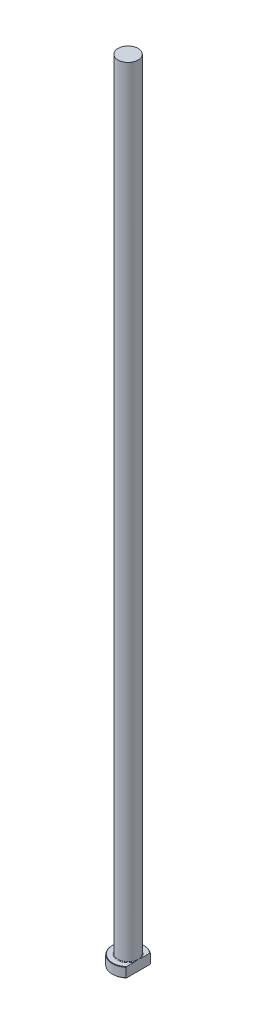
ISO-10303-21;
HEADER;
FILE_DESCRIPTION(('STEP AP214'),'2;1');
FILE_NAME('part.step','',(''),(''),'','','');
FILE_SCHEMA(('AUTOMOTIVE_DESIGN { 1 0 10303 214 1 1 1 1 }'));
ENDSEC;
DATA;
#1=APPLICATION_CONTEXT('core data for automotive mechanical design processes');
#2=APPLICATION_PROTOCOL_DEFINITION('international standard','automotive_design',2000,#1);
#3=PRODUCT_CONTEXT('',#1,'mechanical');
#4=PRODUCT('Part','Part','',(#3));
#5=PRODUCT_RELATED_PRODUCT_CATEGORY('part','',(#4));
#6=PRODUCT_DEFINITION_FORMATION('','',#4);
#7=PRODUCT_DEFINITION_CONTEXT('part definition',#1,'design');
#8=PRODUCT_DEFINITION('design','',#6,#7);
#9=PRODUCT_DEFINITION_SHAPE('','',#8);
#10=(LENGTH_UNIT() NAMED_UNIT(*) SI_UNIT(.MILLI.,.METRE.));
#11=(NAMED_UNIT(*) PLANE_ANGLE_UNIT() SI_UNIT($,.RADIAN.));
#12=(NAMED_UNIT(*) SI_UNIT($,.STERADIAN.) SOLID_ANGLE_UNIT());
#13=UNCERTAINTY_MEASURE_WITH_UNIT(LENGTH_MEASURE(1.E-05),#10,'distance_accuracy_value','');
#14=(GEOMETRIC_REPRESENTATION_CONTEXT(3) GLOBAL_UNCERTAINTY_ASSIGNED_CONTEXT((#13)) GLOBAL_UNIT_ASSIGNED_CONTEXT((#10,
#11,#12)) REPRESENTATION_CONTEXT('',''));
#15=CARTESIAN_POINT('',(0.,0.,0.));
#16=DIRECTION('',(0.,0.,1.));
#17=DIRECTION('',(1.,0.,0.));
#18=AXIS2_PLACEMENT_3D('',#15,#16,#17);
#19=CARTESIAN_POINT('',(0.,0.,0.));
#20=DIRECTION('',(0.,-1.,0.));
#21=DIRECTION('',(0.,0.,-1.));
#22=AXIS2_PLACEMENT_3D('',#19,#20,#21);
#23=PLANE('',#22);
#24=CARTESIAN_POINT('',(0.,0.,0.));
#25=DIRECTION('',(0.,-1.,0.));
#26=DIRECTION('',(0.,0.,-1.));
#27=AXIS2_PLACEMENT_3D('',#24,#25,#26);
#28=CIRCLE('',#27,7.79999999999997);
#29=CARTESIAN_POINT('',(5.09999999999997,0.,5.90169467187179));
#30=VERTEX_POINT('',#29);
#31=CARTESIAN_POINT('',(5.09999999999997,0.,-5.90169467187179));
#32=VERTEX_POINT('',#31);
#33=EDGE_CURVE('E98',#30,#32,#28,.T.);
#34=ORIENTED_EDGE('',*,*,#33,.T.);
#35=DIRECTION('',(0.,0.,1.));
#36=VECTOR('',#35,1.);
#37=CARTESIAN_POINT('',(5.09999999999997,0.,-6.16360284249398));
#38=LINE('',#37,#36);
#39=EDGE_CURVE('E83',#32,#30,#38,.T.);
#40=ORIENTED_EDGE('',*,*,#39,.T.);
#41=EDGE_LOOP('',(#34,#40));
#42=FACE_BOUND('',#41,.T.);
#43=ADVANCED_FACE('F32',(#42),#23,.T.);
#44=CARTESIAN_POINT('',(0.,259.958771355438,0.));
#45=DIRECTION('',(0.,1.,0.));
#46=DIRECTION('',(0.,0.,1.));
#47=AXIS2_PLACEMENT_3D('',#44,#45,#46);
#48=CYLINDRICAL_SURFACE('',#47,7.99999999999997);
#49=CARTESIAN_POINT('',(0.,4.79999999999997,0.));
#50=DIRECTION('',(0.,1.,0.));
#51=DIRECTION('',(0.,0.,1.));
#52=AXIS2_PLACEMENT_3D('',#49,#50,#51);
#53=CIRCLE('',#52,7.99999999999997);
#54=CARTESIAN_POINT('',(5.09999999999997,4.79999999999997,6.16360284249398));
#55=VERTEX_POINT('',#54);
#56=CARTESIAN_POINT('',(5.09999999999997,4.79999999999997,-6.16360284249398));
#57=VERTEX_POINT('',#56);
#58=EDGE_CURVE('E104',#55,#57,#53,.F.);
#59=ORIENTED_EDGE('',*,*,#58,.T.);
#60=DIRECTION('',(0.,-1.,0.));
#61=VECTOR('',#60,1.);
#62=CARTESIAN_POINT('',(5.09999999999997,400.,-6.16360284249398));
#63=LINE('',#62,#61);
#64=CARTESIAN_POINT('',(5.09999999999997,0.199999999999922,-6.16360284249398));
#65=VERTEX_POINT('',#64);
#66=EDGE_CURVE('E183',#57,#65,#63,.T.);
#67=ORIENTED_EDGE('',*,*,#66,.T.);
#68=CARTESIAN_POINT('',(0.,0.199999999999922,0.));
#69=DIRECTION('',(0.,-1.,0.));
#70=DIRECTION('',(0.,0.,-1.));
#71=AXIS2_PLACEMENT_3D('',#68,#69,#70);
#72=CIRCLE('',#71,7.99999999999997);
#73=CARTESIAN_POINT('',(5.09999999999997,0.199999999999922,6.16360284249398));
#74=VERTEX_POINT('',#73);
#75=EDGE_CURVE('E100',#65,#74,#72,.F.);
#76=ORIENTED_EDGE('',*,*,#75,.T.);
#77=DIRECTION('',(0.,-1.,0.));
#78=VECTOR('',#77,1.);
#79=CARTESIAN_POINT('',(5.09999999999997,400.,6.16360284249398));
#80=LINE('',#79,#78);
#81=EDGE_CURVE('E93',#55,#74,#80,.T.);
#82=ORIENTED_EDGE('',*,*,#81,.F.);
#83=EDGE_LOOP('',(#59,#67,#76,#82));
#84=FACE_BOUND('',#83,.T.);
#85=ADVANCED_FACE('F158',(#84),#48,.T.);
#86=CARTESIAN_POINT('',(-7.99999999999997,5.,0.));
#87=DIRECTION('',(0.,1.,0.));
#88=DIRECTION('',(0.,0.,1.));
#89=AXIS2_PLACEMENT_3D('',#86,#87,#88);
#90=PLANE('',#89);
#91=CARTESIAN_POINT('',(0.,5.,0.));
#92=DIRECTION('',(0.,1.,0.));
#93=DIRECTION('',(0.,0.,1.));
#94=AXIS2_PLACEMENT_3D('',#91,#92,#93);
#95=CIRCLE('',#94,7.79999999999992);
#96=CARTESIAN_POINT('',(5.09999999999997,5.,-5.90169467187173));
#97=VERTEX_POINT('',#96);
#98=CARTESIAN_POINT('',(5.09999999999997,5.,5.90169467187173));
#99=VERTEX_POINT('',#98);
#100=EDGE_CURVE('E178',#97,#99,#95,.T.);
#101=ORIENTED_EDGE('',*,*,#100,.T.);
#102=DIRECTION('',(0.,0.,-1.));
#103=VECTOR('',#102,1.);
#104=CARTESIAN_POINT('',(5.09999999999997,5.,0.));
#105=LINE('',#104,#103);
#106=CARTESIAN_POINT('',(5.09999999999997,4.99999999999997,1.77482393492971));
#107=VERTEX_POINT('',#106);
#108=EDGE_CURVE('E57',#99,#107,#105,.T.);
#109=ORIENTED_EDGE('',*,*,#108,.T.);
#110=CARTESIAN_POINT('',(0.,5.,0.));
#111=DIRECTION('',(0.,1.,0.));
#112=DIRECTION('',(0.,0.,1.));
#113=AXIS2_PLACEMENT_3D('',#110,#111,#112);
#114=CIRCLE('',#113,5.39999999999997);
#115=CARTESIAN_POINT('',(5.09999999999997,4.99999999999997,-1.77482393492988));
#116=VERTEX_POINT('',#115);
#117=EDGE_CURVE('E107',#107,#116,#114,.F.);
#118=ORIENTED_EDGE('',*,*,#117,.T.);
#119=EDGE_CURVE('E136',#116,#97,#105,.T.);
#120=ORIENTED_EDGE('',*,*,#119,.T.);
#121=EDGE_LOOP('',(#101,#109,#118,#120));
#122=FACE_BOUND('',#121,.T.);
#123=ADVANCED_FACE('F147',(#122),#90,.T.);
#124=CARTESIAN_POINT('',(0.,5.,0.));
#125=DIRECTION('',(0.,-1.,0.));
#126=DIRECTION('',(0.,0.,-1.));
#127=AXIS2_PLACEMENT_3D('',#124,#125,#126);
#128=CONICAL_SURFACE('',#127,7.79999999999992,0.785398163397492);
#129=ORIENTED_EDGE('',*,*,#58,.F.);
#130=CARTESIAN_POINT('',(5.09999999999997,-1.68838926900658,13.5610996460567));
#131=CARTESIAN_POINT('',(5.09999999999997,-1.49117445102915,13.3503958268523));
#132=CARTESIAN_POINT('',(5.09999999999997,-1.29425912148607,13.1394117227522));
#133=CARTESIAN_POINT('',(5.09999999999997,-0.90112453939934,12.7167935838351));
#134=CARTESIAN_POINT('',(5.09999999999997,-0.704905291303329,12.5051595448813));
#135=CARTESIAN_POINT('',(5.09999999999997,-0.117342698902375,11.8690459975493));
#136=CARTESIAN_POINT('',(5.09999999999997,0.272806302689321,11.4434608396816));
#137=CARTESIAN_POINT('',(5.09999999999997,1.05193640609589,10.5848872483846));
#138=CARTESIAN_POINT('',(5.09999999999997,1.44088225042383,10.1518667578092));
#139=CARTESIAN_POINT('',(5.09999999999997,2.21252525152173,9.28039822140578));
#140=CARTESIAN_POINT('',(5.09999999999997,2.59522339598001,8.84195105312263));
#141=CARTESIAN_POINT('',(5.09999999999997,3.28346545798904,8.03678680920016));
#142=CARTESIAN_POINT('',(5.09999999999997,3.59050446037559,7.67135442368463));
#143=CARTESIAN_POINT('',(5.09999999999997,4.04444149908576,7.1176457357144));
#144=CARTESIAN_POINT('',(5.09999999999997,4.19468098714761,6.93211011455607));
#145=CARTESIAN_POINT('',(5.09999999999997,4.49242146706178,6.55885365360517));
#146=CARTESIAN_POINT('',(5.09999999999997,4.63992249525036,6.37113284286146));
#147=CARTESIAN_POINT('',(5.09999999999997,4.93124846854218,5.99346825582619));
#148=CARTESIAN_POINT('',(5.09999999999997,5.0750803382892,5.80352983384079));
#149=CARTESIAN_POINT('',(5.09999999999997,5.3585396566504,5.42051054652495));
#150=CARTESIAN_POINT('',(5.09999999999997,5.49816682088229,5.22742946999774));
#151=CARTESIAN_POINT('',(5.09999999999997,5.77196390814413,4.83761664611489));
#152=CARTESIAN_POINT('',(5.09999999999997,5.90613746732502,4.64088746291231));
#153=CARTESIAN_POINT('',(5.09999999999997,6.16753864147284,4.24288639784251));
#154=CARTESIAN_POINT('',(5.09999999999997,6.29476755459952,4.0416153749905));
#155=CARTESIAN_POINT('',(5.09999999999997,6.51869473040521,3.6691800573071));
#156=CARTESIAN_POINT('',(5.09999999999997,6.61684568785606,3.49889306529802));
#157=CARTESIAN_POINT('',(5.09999999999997,6.80528626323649,3.15396122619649));
#158=CARTESIAN_POINT('',(5.09999999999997,6.89557493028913,2.97931585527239));
#159=CARTESIAN_POINT('',(5.09999999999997,7.0660493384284,2.62530631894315));
#160=CARTESIAN_POINT('',(5.09999999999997,7.14624387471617,2.44594642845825));
#161=CARTESIAN_POINT('',(5.09999999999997,7.29389284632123,2.08202755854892));
#162=CARTESIAN_POINT('',(5.09999999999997,7.36135077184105,1.89747001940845));
#163=CARTESIAN_POINT('',(5.09999999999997,7.46787946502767,1.56242413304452));
#164=CARTESIAN_POINT('',(5.09999999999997,7.50993657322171,1.41289089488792));
#165=CARTESIAN_POINT('',(5.09999999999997,7.58244227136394,1.11101527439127));
#166=CARTESIAN_POINT('',(5.09999999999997,7.61289239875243,0.958673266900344));
#167=CARTESIAN_POINT('',(5.09999999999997,7.66066060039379,0.652384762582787));
#168=CARTESIAN_POINT('',(5.09999999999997,7.6780179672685,0.498444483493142));
#169=CARTESIAN_POINT('',(5.09999999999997,7.69880109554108,0.189616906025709));
#170=CARTESIAN_POINT('',(5.09999999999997,7.70222744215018,0.0347296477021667));
#171=CARTESIAN_POINT('',(5.09999999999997,7.69494415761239,-0.274953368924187));
#172=CARTESIAN_POINT('',(5.09999999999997,7.68421202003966,-0.429748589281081));
#173=CARTESIAN_POINT('',(5.09999999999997,7.64918519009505,-0.737784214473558));
#174=CARTESIAN_POINT('',(5.09999999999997,7.62488939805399,-0.89102449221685));
#175=CARTESIAN_POINT('',(5.09999999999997,7.56389278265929,-1.19546940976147));
#176=CARTESIAN_POINT('',(5.09999999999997,7.52715417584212,-1.34666637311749));
#177=CARTESIAN_POINT('',(5.09999999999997,7.44288917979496,-1.64598767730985));
#178=CARTESIAN_POINT('',(5.09999999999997,7.39536249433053,-1.79411193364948));
#179=CARTESIAN_POINT('',(5.09999999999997,7.2828636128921,-2.110452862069));
#180=CARTESIAN_POINT('',(5.09999999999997,7.21631794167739,-2.27810587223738));
#181=CARTESIAN_POINT('',(5.09999999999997,7.07327742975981,-2.60914825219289));
#182=CARTESIAN_POINT('',(5.09999999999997,6.99677812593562,-2.77253566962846));
#183=CARTESIAN_POINT('',(5.09999999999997,6.83568399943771,-3.09559415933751));
#184=CARTESIAN_POINT('',(5.09999999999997,6.75107532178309,-3.25525827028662));
#185=CARTESIAN_POINT('',(5.09999999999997,6.5754739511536,-3.57098467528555));
#186=CARTESIAN_POINT('',(5.09999999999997,6.48448213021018,-3.7270474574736));
#187=CARTESIAN_POINT('',(5.09999999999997,6.29613682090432,-4.03803676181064));
#188=CARTESIAN_POINT('',(5.09999999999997,6.19871627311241,-4.1929224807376));
#189=CARTESIAN_POINT('',(5.09999999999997,5.9995920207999,-4.49991023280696));
#190=CARTESIAN_POINT('',(5.09999999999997,5.89788820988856,-4.65201219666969));
#191=CARTESIAN_POINT('',(5.09999999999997,5.69108681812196,-4.95365388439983));
#192=CARTESIAN_POINT('',(5.09999999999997,5.58599284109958,-5.10319608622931));
#193=CARTESIAN_POINT('',(5.09999999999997,5.3729210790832,-5.40020343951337));
#194=CARTESIAN_POINT('',(5.09999999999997,5.26494333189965,-5.54766861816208));
#195=CARTESIAN_POINT('',(5.09999999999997,5.02178839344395,-5.87409503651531));
#196=CARTESIAN_POINT('',(5.09999999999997,4.88600343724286,-6.05260304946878));
#197=CARTESIAN_POINT('',(5.09999999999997,4.61149829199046,-6.40735082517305));
#198=CARTESIAN_POINT('',(5.09999999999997,4.4727780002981,-6.58359050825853));
#199=CARTESIAN_POINT('',(5.09999999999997,4.05300130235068,-7.10948762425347));
#200=CARTESIAN_POINT('',(5.09999999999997,3.76835961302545,-7.45628264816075));
#201=CARTESIAN_POINT('',(5.09999999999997,3.19218529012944,-8.14465597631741));
#202=CARTESIAN_POINT('',(5.09999999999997,2.90064601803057,-8.48622868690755));
#203=CARTESIAN_POINT('',(5.09999999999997,2.31275375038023,-9.16521513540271));
#204=CARTESIAN_POINT('',(5.09999999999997,2.0164006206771,-9.50262875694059));
#205=CARTESIAN_POINT('',(5.09999999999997,1.43877149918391,-10.1532482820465));
#206=CARTESIAN_POINT('',(5.09999999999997,1.15771277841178,-10.4666475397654));
#207=CARTESIAN_POINT('',(5.09999999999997,0.593133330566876,-11.0912313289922));
#208=CARTESIAN_POINT('',(5.09999999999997,0.309612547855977,-11.4024158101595));
#209=CARTESIAN_POINT('',(5.09999999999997,-0.258772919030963,-12.0223487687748));
#210=CARTESIAN_POINT('',(5.09999999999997,-0.543633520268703,-12.3311009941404));
#211=CARTESIAN_POINT('',(5.09999999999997,-1.11492174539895,-12.9471274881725));
#212=CARTESIAN_POINT('',(5.09999999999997,-1.4013492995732,-13.2544018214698));
#213=CARTESIAN_POINT('',(5.09999999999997,-1.68838926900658,-13.5610996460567));
#214=B_SPLINE_CURVE_WITH_KNOTS('',3,(#130,#131,#132,#133,#134,#135,#136,#137,#138,#139,#140,
#141,#142,#143,#144,#145,#146,#147,#148,#149,#150,#151,#152,#153,#154,#155,#156,#157,#158,#159,
#160,#161,#162,#163,#164,#165,#166,#167,#168,#169,#170,#171,#172,#173,#174,#175,#176,#177,#178,
#179,#180,#181,#182,#183,#184,#185,#186,#187,#188,#189,#190,#191,#192,#193,#194,#195,#196,#197,
#198,#199,#200,#201,#202,#203,#204,#205,#206,#207,#208,#209,#210,#211,#212,#213),.UNSPECIFIED.,
.F.,.F.,(4,2,2,2,2,2,2,2,2,2,2,2,2,2,2,2,2,2,2,2,2,2,2,2,2,2,2,2,2,2,2,2,2,2,2,2,2,2,2,2,2,4),
(0.,0.865798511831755,1.73160254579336,3.4636456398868,5.20976443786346,6.95560446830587,
8.38738766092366,9.10357880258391,9.81976043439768,10.5344719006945,11.249231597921,
11.9635066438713,12.677647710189,13.2671324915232,13.8566884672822,14.4457271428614,
15.0346041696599,15.5002159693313,15.9657660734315,16.4299133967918,16.8940412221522,
17.3589077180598,17.8238119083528,18.2901406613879,18.7564822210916,19.2972067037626,
19.838174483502,20.3800835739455,20.9219187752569,21.470762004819,22.01961887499,
22.5679103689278,23.1161946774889,23.7890028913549,24.4618346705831,25.807650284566,
27.1548185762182,28.5020244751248,29.7649097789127,31.0278236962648,32.2880803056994,
33.5482812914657),.UNSPECIFIED.);
#215=EDGE_CURVE('E135',#55,#99,#214,.T.);
#216=ORIENTED_EDGE('',*,*,#215,.T.);
#217=ORIENTED_EDGE('',*,*,#100,.F.);
#218=EDGE_CURVE('E127',#97,#57,#214,.T.);
#219=ORIENTED_EDGE('',*,*,#218,.T.);
#220=EDGE_LOOP('',(#129,#216,#217,#219));
#221=FACE_BOUND('',#220,.T.);
#222=ADVANCED_FACE('F143',(#221),#128,.T.);
#223=CARTESIAN_POINT('',(0.,0.199999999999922,0.));
#224=DIRECTION('',(0.,1.,0.));
#225=DIRECTION('',(0.,0.,1.));
#226=AXIS2_PLACEMENT_3D('',#223,#224,#225);
#227=CONICAL_SURFACE('',#226,7.99999999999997,0.78539816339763);
#228=ORIENTED_EDGE('',*,*,#75,.F.);
#229=CARTESIAN_POINT('',(5.09999999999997,6.68838926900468,-13.5610996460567));
#230=CARTESIAN_POINT('',(5.09999999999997,6.49117445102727,-13.3503958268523));
#231=CARTESIAN_POINT('',(5.09999999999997,6.29425912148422,-13.1394117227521));
#232=CARTESIAN_POINT('',(5.09999999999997,5.90112453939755,-12.7167935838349));
#233=CARTESIAN_POINT('',(5.09999999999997,5.70490529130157,-12.5051595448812));
#234=CARTESIAN_POINT('',(5.09999999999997,5.11734269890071,-11.869045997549));
#235=CARTESIAN_POINT('',(5.09999999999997,4.72719369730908,-11.4434608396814));
#236=CARTESIAN_POINT('',(5.09999999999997,3.94806359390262,-10.5848872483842));
#237=CARTESIAN_POINT('',(5.09999999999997,3.55911774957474,-10.1518667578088));
#238=CARTESIAN_POINT('',(5.09999999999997,2.78747474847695,-9.28039822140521));
#239=CARTESIAN_POINT('',(5.09999999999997,2.40477660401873,-8.84195105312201));
#240=CARTESIAN_POINT('',(5.09999999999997,1.71653454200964,-8.03678680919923));
#241=CARTESIAN_POINT('',(5.09999999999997,1.40949553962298,-7.67135442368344));
#242=CARTESIAN_POINT('',(5.09999999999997,0.955558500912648,-7.11764573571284));
#243=CARTESIAN_POINT('',(5.09999999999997,0.805319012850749,-6.93211011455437));
#244=CARTESIAN_POINT('',(5.09999999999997,0.507578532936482,-6.55885365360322));
#245=CARTESIAN_POINT('',(5.09999999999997,0.360077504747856,-6.37113284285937));
#246=CARTESIAN_POINT('',(5.09999999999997,0.0687515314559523,-5.99346825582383));
#247=CARTESIAN_POINT('',(5.09999999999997,-0.075080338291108,-5.8035298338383));
#248=CARTESIAN_POINT('',(5.09999999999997,-0.358539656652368,-5.42051054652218));
#249=CARTESIAN_POINT('',(5.09999999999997,-0.498166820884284,-5.22742946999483));
#250=CARTESIAN_POINT('',(5.09999999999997,-0.771963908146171,-4.8376166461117));
#251=CARTESIAN_POINT('',(5.09999999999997,-0.906137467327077,-4.64088746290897));
#252=CARTESIAN_POINT('',(5.09999999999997,-1.1675386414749,-4.24288639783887));
#253=CARTESIAN_POINT('',(5.09999999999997,-1.29476755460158,-4.0416153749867));
#254=CARTESIAN_POINT('',(5.09999999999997,-1.51869473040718,-3.6691800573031));
#255=CARTESIAN_POINT('',(5.09999999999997,-1.61684568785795,-3.49889306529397));
#256=CARTESIAN_POINT('',(5.09999999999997,-1.80528626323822,-3.15396122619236));
#257=CARTESIAN_POINT('',(5.09999999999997,-1.89557493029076,-2.97931585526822));
#258=CARTESIAN_POINT('',(5.09999999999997,-2.06604933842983,-2.62530631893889));
#259=CARTESIAN_POINT('',(5.09999999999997,-2.14624387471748,-2.44594642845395));
#260=CARTESIAN_POINT('',(5.09999999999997,-2.2938928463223,-2.08202755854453));
#261=CARTESIAN_POINT('',(5.09999999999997,-2.361350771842,-1.89747001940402));
#262=CARTESIAN_POINT('',(5.09999999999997,-2.46787946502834,-1.56242413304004));
#263=CARTESIAN_POINT('',(5.09999999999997,-2.50993657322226,-1.41289089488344));
#264=CARTESIAN_POINT('',(5.09999999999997,-2.58244227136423,-1.11101527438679));
#265=CARTESIAN_POINT('',(5.09999999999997,-2.61289239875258,-0.958673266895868));
#266=CARTESIAN_POINT('',(5.09999999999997,-2.66066060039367,-0.652384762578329));
#267=CARTESIAN_POINT('',(5.09999999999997,-2.67801796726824,-0.498444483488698));
#268=CARTESIAN_POINT('',(5.09999999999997,-2.69880109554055,-0.189616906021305));
#269=CARTESIAN_POINT('',(5.09999999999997,-2.70222744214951,-0.034729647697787));
#270=CARTESIAN_POINT('',(5.09999999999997,-2.69494415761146,0.274953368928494));
#271=CARTESIAN_POINT('',(5.09999999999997,-2.6842120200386,0.429748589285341));
#272=CARTESIAN_POINT('',(5.09999999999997,-2.64918519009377,0.737784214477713));
#273=CARTESIAN_POINT('',(5.09999999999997,-2.6248893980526,0.891024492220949));
#274=CARTESIAN_POINT('',(5.09999999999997,-2.56389278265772,1.19546940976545));
#275=CARTESIAN_POINT('',(5.09999999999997,-2.52715417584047,1.34666637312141));
#276=CARTESIAN_POINT('',(5.09999999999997,-2.44288917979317,1.64598767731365));
#277=CARTESIAN_POINT('',(5.09999999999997,-2.39536249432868,1.79411193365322));
#278=CARTESIAN_POINT('',(5.09999999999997,-2.28286361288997,2.11045286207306));
#279=CARTESIAN_POINT('',(5.09999999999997,-2.21631794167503,2.2781058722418));
#280=CARTESIAN_POINT('',(5.09999999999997,-2.07327742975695,2.60914825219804));
#281=CARTESIAN_POINT('',(5.09999999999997,-1.99677812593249,2.77253566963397));
#282=CARTESIAN_POINT('',(5.09999999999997,-1.83568399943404,3.0955941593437));
#283=CARTESIAN_POINT('',(5.09999999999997,-1.75107532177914,3.25525827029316));
#284=CARTESIAN_POINT('',(5.09999999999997,-1.57547395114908,3.57098467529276));
#285=CARTESIAN_POINT('',(5.09999999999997,-1.48448213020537,3.72704745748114));
#286=CARTESIAN_POINT('',(5.09999999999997,-1.29613682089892,4.03803676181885));
#287=CARTESIAN_POINT('',(5.09999999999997,-1.19871627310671,4.19292248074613));
#288=CARTESIAN_POINT('',(5.09999999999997,-0.999592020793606,4.49991023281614));
#289=CARTESIAN_POINT('',(5.09999999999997,-0.897888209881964,4.65201219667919));
#290=CARTESIAN_POINT('',(5.09999999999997,-0.691086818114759,4.95365388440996));
#291=CARTESIAN_POINT('',(5.09999999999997,-0.585992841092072,5.10319608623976));
#292=CARTESIAN_POINT('',(5.09999999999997,-0.372921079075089,5.40020343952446));
#293=CARTESIAN_POINT('',(5.09999999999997,-0.264943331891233,5.54766861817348));
#294=CARTESIAN_POINT('',(5.09999999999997,-0.0217883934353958,5.87409503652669));
#295=CARTESIAN_POINT('',(5.09999999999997,0.113996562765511,6.05260304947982));
#296=CARTESIAN_POINT('',(5.09999999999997,0.388501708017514,6.40735082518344));
#297=CARTESIAN_POINT('',(5.09999999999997,0.527221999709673,6.58359050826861));
#298=CARTESIAN_POINT('',(5.09999999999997,0.946998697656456,7.10948762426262));
#299=CARTESIAN_POINT('',(5.09999999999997,1.23164038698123,7.45628264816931));
#300=CARTESIAN_POINT('',(5.09999999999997,1.80781470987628,8.1446559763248));
#301=CARTESIAN_POINT('',(5.09999999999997,2.09935398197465,8.48622868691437));
#302=CARTESIAN_POINT('',(5.09999999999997,2.68724624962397,9.16521513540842));
#303=CARTESIAN_POINT('',(5.09999999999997,2.98359937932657,9.50262875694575));
#304=CARTESIAN_POINT('',(5.09999999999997,3.56122850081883,10.1532482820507));
#305=CARTESIAN_POINT('',(5.09999999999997,3.84228722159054,10.4666475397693));
#306=CARTESIAN_POINT('',(5.09999999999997,4.40686666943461,11.0912313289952));
#307=CARTESIAN_POINT('',(5.09999999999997,4.69038745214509,11.4024158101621));
#308=CARTESIAN_POINT('',(5.09999999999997,5.25877291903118,12.0223487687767));
#309=CARTESIAN_POINT('',(5.09999999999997,5.5436335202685,12.3311009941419));
#310=CARTESIAN_POINT('',(5.09999999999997,6.1149217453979,12.9471274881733));
#311=CARTESIAN_POINT('',(5.09999999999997,6.40134929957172,13.2544018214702));
#312=CARTESIAN_POINT('',(5.09999999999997,6.68838926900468,13.5610996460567));
#313=B_SPLINE_CURVE_WITH_KNOTS('',3,(#229,#230,#231,#232,#233,#234,#235,#236,#237,#238,#239,
#240,#241,#242,#243,#244,#245,#246,#247,#248,#249,#250,#251,#252,#253,#254,#255,#256,#257,#258,
#259,#260,#261,#262,#263,#264,#265,#266,#267,#268,#269,#270,#271,#272,#273,#274,#275,#276,#277,
#278,#279,#280,#281,#282,#283,#284,#285,#286,#287,#288,#289,#290,#291,#292,#293,#294,#295,#296,
#297,#298,#299,#300,#301,#302,#303,#304,#305,#306,#307,#308,#309,#310,#311,#312),.UNSPECIFIED.,
.F.,.F.,(4,2,2,2,2,2,2,2,2,2,2,2,2,2,2,2,2,2,2,2,2,2,2,2,2,2,2,2,2,2,2,2,2,2,2,2,2,2,2,2,2,4),
(0.,0.865798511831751,1.73160254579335,3.46364563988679,5.20976443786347,6.95560446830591,
8.38738766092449,9.10357880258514,9.8197604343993,10.5344719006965,11.2492315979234,
11.9635066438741,12.6776477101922,13.2671324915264,13.8566884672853,14.4457271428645,
15.034604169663,15.5002159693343,15.9657660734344,16.4299133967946,16.894041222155,
17.3589077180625,17.8238119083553,18.2901406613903,18.7564822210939,19.2972067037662,
19.8381744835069,20.3800835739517,20.9219187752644,21.4707620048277,22.0196188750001,
22.5679103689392,23.1161946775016,23.7890028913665,24.4618346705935,25.8076502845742,
27.1548185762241,28.5020244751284,29.7649097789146,31.027823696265,32.2880803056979,
33.5482812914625),.UNSPECIFIED.);
#314=EDGE_CURVE('E86',#65,#32,#313,.T.);
#315=ORIENTED_EDGE('',*,*,#314,.T.);
#316=ORIENTED_EDGE('',*,*,#33,.F.);
#317=EDGE_CURVE('E89',#30,#74,#313,.T.);
#318=ORIENTED_EDGE('',*,*,#317,.T.);
#319=EDGE_LOOP('',(#228,#315,#316,#318));
#320=FACE_BOUND('',#319,.T.);
#321=ADVANCED_FACE('F97',(#320),#227,.T.);
#322=CARTESIAN_POINT('',(0.,5.29999999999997,0.));
#323=DIRECTION('',(0.,1.,0.));
#324=DIRECTION('',(0.,0.,1.));
#325=AXIS2_PLACEMENT_3D('',#322,#323,#324);
#326=TOROIDAL_SURFACE('',#325,5.39999999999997,0.3);
#327=CARTESIAN_POINT('',(5.09999999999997,5.29999999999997,0.));
#328=CARTESIAN_POINT('',(5.09999999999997,5.30000062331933,1.00502423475E-10));
#329=CARTESIAN_POINT('',(5.09999999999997,5.30000124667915,-2.56272245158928E-07));
#330=CARTESIAN_POINT('',(5.09999999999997,5.30000240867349,-9.58155656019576E-07));
#331=CARTESIAN_POINT('',(5.09999999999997,5.30000293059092,-1.42128215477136E-06));
#332=CARTESIAN_POINT('',(5.09999999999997,5.30000402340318,-2.53262703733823E-06));
#333=CARTESIAN_POINT('',(5.09999999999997,5.30000457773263,-3.19888436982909E-06));
#334=CARTESIAN_POINT('',(5.09999999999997,5.30000556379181,-4.57422758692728E-06));
#335=CARTESIAN_POINT('',(5.09999999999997,5.30000599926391,-5.28085592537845E-06));
#336=CARTESIAN_POINT('',(5.09999999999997,5.30000763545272,-8.04031793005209E-06));
#337=CARTESIAN_POINT('',(5.09999999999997,5.30000874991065,-1.01478584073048E-05));
#338=CARTESIAN_POINT('',(5.09999999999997,5.30001056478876,-1.43037796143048E-05));
#339=CARTESIAN_POINT('',(5.09999999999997,5.30001129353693,-1.6340275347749E-05));
#340=CARTESIAN_POINT('',(5.09999999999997,5.30001438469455,-2.50239477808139E-05));
#341=CARTESIAN_POINT('',(5.09999999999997,5.30001671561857,-3.168576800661E-05));
#342=CARTESIAN_POINT('',(5.09999999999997,5.30002011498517,-4.42245824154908E-05));
#343=CARTESIAN_POINT('',(5.09999999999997,5.30002132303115,-5.00633656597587E-05));
#344=CARTESIAN_POINT('',(5.09999999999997,5.30003017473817,-9.36444945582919E-05));
#345=CARTESIAN_POINT('',(5.09999999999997,5.30003694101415,-0.00013150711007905));
#346=CARTESIAN_POINT('',(5.09999999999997,5.30006656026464,-0.000281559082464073));
#347=CARTESIAN_POINT('',(5.09999999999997,5.30009476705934,-0.000392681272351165));
#348=CARTESIAN_POINT('',(5.09999999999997,5.30020497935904,-0.000834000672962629));
#349=CARTESIAN_POINT('',(5.09999999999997,5.30028356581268,-0.00116477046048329));
#350=CARTESIAN_POINT('',(5.09999999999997,5.30059910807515,-0.00248331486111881));
#351=CARTESIAN_POINT('',(5.09999999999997,5.30084040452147,-0.00347033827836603));
#352=CARTESIAN_POINT('',(5.09999999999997,5.30184681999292,-0.00759777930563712));
#353=CARTESIAN_POINT('',(5.09999999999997,5.30260646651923,-0.0107391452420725));
#354=CARTESIAN_POINT('',(5.09999999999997,5.30990583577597,-0.0409103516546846));
#355=CARTESIAN_POINT('',(5.09999999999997,5.31647007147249,-0.0679360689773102));
#356=CARTESIAN_POINT('',(5.09999999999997,5.32929459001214,-0.120902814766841));
#357=CARTESIAN_POINT('',(5.09999999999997,5.3355564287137,-0.146843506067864));
#358=CARTESIAN_POINT('',(5.09999999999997,5.3488421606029,-0.202060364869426));
#359=CARTESIAN_POINT('',(5.09999999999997,5.35586083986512,-0.231337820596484));
#360=CARTESIAN_POINT('',(5.09999999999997,5.36989412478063,-0.290236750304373));
#361=CARTESIAN_POINT('',(5.09999999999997,5.37690782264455,-0.319858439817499));
#362=CARTESIAN_POINT('',(5.09999999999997,5.39370531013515,-0.391396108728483));
#363=CARTESIAN_POINT('',(5.09999999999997,5.40343385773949,-0.433325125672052));
#364=CARTESIAN_POINT('',(5.09999999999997,5.42233571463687,-0.516161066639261));
#365=CARTESIAN_POINT('',(5.09999999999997,5.43151688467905,-0.55706619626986));
#366=CARTESIAN_POINT('',(5.09999999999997,5.45452080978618,-0.66177738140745));
#367=CARTESIAN_POINT('',(5.09999999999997,5.46807892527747,-0.725642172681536));
#368=CARTESIAN_POINT('',(5.09999999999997,5.4940673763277,-0.854162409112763));
#369=CARTESIAN_POINT('',(5.09999999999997,5.5064872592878,-0.918819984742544));
#370=CARTESIAN_POINT('',(5.09999999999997,5.53078685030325,-1.05464624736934));
#371=CARTESIAN_POINT('',(5.09999999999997,5.5425007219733,-1.12584508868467));
#372=CARTESIAN_POINT('',(5.09999999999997,5.56331904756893,-1.26861848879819));
#373=CARTESIAN_POINT('',(5.09999999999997,5.57242395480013,-1.34019298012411));
#374=CARTESIAN_POINT('',(5.09999999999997,5.58708832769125,-1.48237032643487));
#375=CARTESIAN_POINT('',(5.09999999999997,5.59271078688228,-1.55296638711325));
#376=CARTESIAN_POINT('',(5.09999999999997,5.59964105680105,-1.69455989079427));
#377=CARTESIAN_POINT('',(5.09999999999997,5.60093824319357,-1.76555789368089));
#378=CARTESIAN_POINT('',(5.09999999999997,5.59769411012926,-1.90544222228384));
#379=CARTESIAN_POINT('',(5.09999999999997,5.59332114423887,-1.97433003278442));
#380=CARTESIAN_POINT('',(5.09999999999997,5.58075096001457,-2.07681569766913));
#381=CARTESIAN_POINT('',(5.09999999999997,5.57557260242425,-2.11078113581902));
#382=CARTESIAN_POINT('',(5.09999999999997,5.56270516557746,-2.17822373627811));
#383=CARTESIAN_POINT('',(5.09999999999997,5.55501865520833,-2.21170136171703));
#384=CARTESIAN_POINT('',(5.09999999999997,5.54146504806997,-2.25971093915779));
#385=CARTESIAN_POINT('',(5.09999999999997,5.53689562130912,-2.27460808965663));
#386=CARTESIAN_POINT('',(5.09999999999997,5.52697250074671,-2.30414012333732));
#387=CARTESIAN_POINT('',(5.09999999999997,5.52161846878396,-2.31877489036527));
#388=CARTESIAN_POINT('',(5.09999999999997,5.50422688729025,-2.36209889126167));
#389=CARTESIAN_POINT('',(5.09999999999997,5.49083502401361,-2.3903019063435));
#390=CARTESIAN_POINT('',(5.09999999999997,5.46786086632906,-2.42877296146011));
#391=CARTESIAN_POINT('',(5.09999999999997,5.4603260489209,-2.44026309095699));
#392=CARTESIAN_POINT('',(5.09999999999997,5.44403681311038,-2.46240090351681));
#393=CARTESIAN_POINT('',(5.09999999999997,5.43527992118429,-2.47304680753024));
#394=CARTESIAN_POINT('',(5.09999999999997,5.41620529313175,-2.49317992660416));
#395=CARTESIAN_POINT('',(5.09999999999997,5.40586565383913,-2.50264683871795));
#396=CARTESIAN_POINT('',(5.09999999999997,5.3835690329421,-2.5194267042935));
#397=CARTESIAN_POINT('',(5.09999999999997,5.37162091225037,-2.5267508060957));
#398=CARTESIAN_POINT('',(5.09999999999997,5.35166538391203,-2.53574339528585));
#399=CARTESIAN_POINT('',(5.09999999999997,5.34414545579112,-2.53849221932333));
#400=CARTESIAN_POINT('',(5.09999999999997,5.32875362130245,-2.5427156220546));
#401=CARTESIAN_POINT('',(5.09999999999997,5.32088204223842,-2.5441913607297));
#402=CARTESIAN_POINT('',(5.09999999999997,5.30496570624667,-2.54573009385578));
#403=CARTESIAN_POINT('',(5.09999999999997,5.29692036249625,-2.54578715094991));
#404=CARTESIAN_POINT('',(5.09999999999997,5.28094771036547,-2.54446730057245));
#405=CARTESIAN_POINT('',(5.09999999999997,5.27302044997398,-2.54308982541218));
#406=CARTESIAN_POINT('',(5.09999999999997,5.25787452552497,-2.53913219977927));
#407=CARTESIAN_POINT('',(5.09999999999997,5.25064005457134,-2.53661104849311));
#408=CARTESIAN_POINT('',(5.09999999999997,5.23660403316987,-2.53057544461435));
#409=CARTESIAN_POINT('',(5.09999999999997,5.22980263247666,-2.52706065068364));
#410=CARTESIAN_POINT('',(5.09999999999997,5.21241680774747,-2.51668428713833));
#411=CARTESIAN_POINT('',(5.09999999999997,5.20224553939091,-2.50913195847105));
#412=CARTESIAN_POINT('',(5.09999999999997,5.18317971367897,-2.49255314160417));
#413=CARTESIAN_POINT('',(5.09999999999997,5.17428964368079,-2.48352169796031));
#414=CARTESIAN_POINT('',(5.09999999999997,5.15120222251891,-2.45711400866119));
#415=CARTESIAN_POINT('',(5.09999999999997,5.13821905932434,-2.43868687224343));
#416=CARTESIAN_POINT('',(5.09999999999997,5.11496748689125,-2.40025423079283));
#417=CARTESIAN_POINT('',(5.09999999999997,5.1047025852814,-2.38024672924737));
#418=CARTESIAN_POINT('',(5.09999999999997,5.0855950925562,-2.33784185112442));
#419=CARTESIAN_POINT('',(5.09999999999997,5.07690690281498,-2.31537591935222));
#420=CARTESIAN_POINT('',(5.09999999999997,5.06139749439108,-2.26979738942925));
#421=CARTESIAN_POINT('',(5.09999999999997,5.05457848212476,-2.24668406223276));
#422=CARTESIAN_POINT('',(5.09999999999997,5.04239975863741,-2.1998307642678));
#423=CARTESIAN_POINT('',(5.09999999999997,5.03705561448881,-2.17608680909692));
#424=CARTESIAN_POINT('',(5.09999999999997,5.02766167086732,-2.12836719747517));
#425=CARTESIAN_POINT('',(5.09999999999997,5.02361095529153,-2.10439171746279));
#426=CARTESIAN_POINT('',(5.09999999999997,5.01439130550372,-2.04113234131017));
#427=CARTESIAN_POINT('',(5.09999999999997,5.01012481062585,-2.00171697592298));
#428=CARTESIAN_POINT('',(5.09999999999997,5.00388663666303,-1.92269917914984));
#429=CARTESIAN_POINT('',(5.09999999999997,5.00191621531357,-1.88309665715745));
#430=CARTESIAN_POINT('',(5.09999999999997,4.99879803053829,-1.76395655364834));
#431=CARTESIAN_POINT('',(5.09999999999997,5.00047462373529,-1.68434528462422));
#432=CARTESIAN_POINT('',(5.09999999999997,5.00888754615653,-1.52975473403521));
#433=CARTESIAN_POINT('',(5.09999999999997,5.01534627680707,-1.45475708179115));
#434=CARTESIAN_POINT('',(5.09999999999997,5.0317664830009,-1.30572790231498));
#435=CARTESIAN_POINT('',(5.09999999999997,5.04170115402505,-1.23169335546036));
#436=CARTESIAN_POINT('',(5.09999999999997,5.06541265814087,-1.07626149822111));
#437=CARTESIAN_POINT('',(5.09999999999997,5.07948398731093,-0.994910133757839));
#438=CARTESIAN_POINT('',(5.09999999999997,5.10254680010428,-0.872231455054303));
#439=CARTESIAN_POINT('',(5.09999999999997,5.11066831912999,-0.830736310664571));
#440=CARTESIAN_POINT('',(5.09999999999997,5.12745388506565,-0.747740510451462));
#441=CARTESIAN_POINT('',(5.09999999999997,5.1361193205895,-0.706240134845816));
#442=CARTESIAN_POINT('',(5.09999999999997,5.15735306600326,-0.607104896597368));
#443=CARTESIAN_POINT('',(5.09999999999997,5.17012138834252,-0.549513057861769));
#444=CARTESIAN_POINT('',(5.09999999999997,5.19610836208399,-0.435113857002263));
#445=CARTESIAN_POINT('',(5.09999999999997,5.20932032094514,-0.378304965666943));
#446=CARTESIAN_POINT('',(5.09999999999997,5.23456914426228,-0.271298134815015));
#447=CARTESIAN_POINT('',(5.09999999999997,5.24656654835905,-0.22109077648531));
#448=CARTESIAN_POINT('',(5.09999999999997,5.27126433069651,-0.118550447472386));
#449=CARTESIAN_POINT('',(5.09999999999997,5.28397269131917,-0.0662193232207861));
#450=CARTESIAN_POINT('',(5.09999999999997,5.29739466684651,-0.0107340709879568));
#451=CARTESIAN_POINT('',(5.09999999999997,5.29815561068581,-0.00758765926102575));
#452=CARTESIAN_POINT('',(5.09999999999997,5.29916232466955,-0.00345908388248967));
#453=CARTESIAN_POINT('',(5.09999999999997,5.29940265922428,-0.00247597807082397));
#454=CARTESIAN_POINT('',(5.09999999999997,5.2997170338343,-0.00116231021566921));
#455=CARTESIAN_POINT('',(5.09999999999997,5.29979539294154,-0.000832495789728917));
#456=CARTESIAN_POINT('',(5.09999999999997,5.29990533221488,-0.000392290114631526));
#457=CARTESIAN_POINT('',(5.09999999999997,5.29993350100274,-0.000281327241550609));
#458=CARTESIAN_POINT('',(5.09999999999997,5.29996308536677,-0.000131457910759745));
#459=CARTESIAN_POINT('',(5.09999999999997,5.29996984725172,-9.36171898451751E-05));
#460=CARTESIAN_POINT('',(5.09999999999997,5.29997868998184,-5.00584682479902E-05));
#461=CARTESIAN_POINT('',(5.09999999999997,5.29997989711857,-4.42208592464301E-05));
#462=CARTESIAN_POINT('',(5.09999999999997,5.29998329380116,-3.16844912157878E-05));
#463=CARTESIAN_POINT('',(5.09999999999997,5.29998562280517,-2.50238809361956E-05));
#464=CARTESIAN_POINT('',(5.09999999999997,5.29998871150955,-1.63414750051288E-05));
#465=CARTESIAN_POINT('',(5.09999999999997,5.29998943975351,-1.43050668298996E-05));
#466=CARTESIAN_POINT('',(5.09999999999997,5.29999125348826,-1.0149241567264E-05));
#467=CARTESIAN_POINT('',(5.09999999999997,5.29999236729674,-8.04169787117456E-06));
#468=CARTESIAN_POINT('',(5.09999999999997,5.29999400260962,-5.28214008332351E-06));
#469=CARTESIAN_POINT('',(5.09999999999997,5.29999443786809,-4.57545909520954E-06));
#470=CARTESIAN_POINT('',(5.09999999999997,5.29999542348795,-3.19997201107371E-06));
#471=CARTESIAN_POINT('',(5.09999999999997,5.29999597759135,-2.53362183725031E-06));
#472=CARTESIAN_POINT('',(5.09999999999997,5.29999707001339,-1.42206069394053E-06));
#473=CARTESIAN_POINT('',(5.09999999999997,5.2999975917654,-9.58819426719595E-07));
#474=CARTESIAN_POINT('',(5.09999999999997,5.29999875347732,-2.56643126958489E-07));
#475=CARTESIAN_POINT('',(5.09999999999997,5.29999937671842,-1.00496326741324E-10));
#476=CARTESIAN_POINT('',(5.09999999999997,5.29999999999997,0.));
#477=B_SPLINE_CURVE_WITH_KNOTS('',3,(#327,#328,#329,#330,#331,#332,#333,#334,#335,#336,#337,
#338,#339,#340,#341,#342,#343,#344,#345,#346,#347,#348,#349,#350,#351,#352,#353,#354,#355,#356,
#357,#358,#359,#360,#361,#362,#363,#364,#365,#366,#367,#368,#369,#370,#371,#372,#373,#374,#375,
#376,#377,#378,#379,#380,#381,#382,#383,#384,#385,#386,#387,#388,#389,#390,#391,#392,#393,#394,
#395,#396,#397,#398,#399,#400,#401,#402,#403,#404,#405,#406,#407,#408,#409,#410,#411,#412,#413,
#414,#415,#416,#417,#418,#419,#420,#421,#422,#423,#424,#425,#426,#427,#428,#429,#430,#431,#432,
#433,#434,#435,#436,#437,#438,#439,#440,#441,#442,#443,#444,#445,#446,#447,#448,#449,#450,#451,
#452,#453,#454,#455,#456,#457,#458,#459,#460,#461,#462,#463,#464,#465,#466,#467,#468,#469,#470,
#471,#472,#473,#474,#475,#476),.UNSPECIFIED.,.T.,.F.,(4,2,2,2,2,2,2,2,2,2,2,2,2,2,2,2,2,2,2,2,2,
2,2,2,2,2,2,2,2,2,2,2,2,2,2,2,2,2,2,2,2,2,2,2,2,2,2,2,2,2,2,2,2,2,2,2,2,2,2,2,2,2,2,2,2,2,2,2,2,
2,2,2,2,2,4),(0.,1.89160361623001E-06,3.99004217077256E-06,6.57353786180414E-06,
9.06254730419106E-06,1.61899929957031E-05,2.26728988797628E-05,4.38126588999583E-05,
6.16789164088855E-05,0.000177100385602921,0.000520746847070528,0.00154098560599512,
0.0045888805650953,0.0142850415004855,0.0977171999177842,0.177775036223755,0.268095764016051,
0.359417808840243,0.488545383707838,0.614312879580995,0.810167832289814,1.00767122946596,
1.2241023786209,1.44049590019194,1.65285112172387,1.86572757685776,2.07242589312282,
2.17543511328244,2.27833915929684,2.32506388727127,2.37180881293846,2.46500788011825,
2.50617281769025,2.54742231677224,2.58930523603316,2.6309662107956,2.65489346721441,
2.67879889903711,2.70280436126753,2.72681932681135,2.74971585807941,2.77262026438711,
2.81040587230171,2.84832076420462,2.91556471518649,2.98289501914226,3.05504478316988,
3.12727935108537,3.20024948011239,3.27316781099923,3.39200983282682,3.51091692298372,
3.74950974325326,3.97524204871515,4.19927066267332,4.4468988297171,4.5737438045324,
4.70092693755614,4.87789308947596,5.05286589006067,5.20772921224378,5.36928080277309,
5.3789925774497,5.38202837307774,5.38304566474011,5.38338882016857,5.38350417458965,
5.38352203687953,5.38354317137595,5.38354965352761,5.38355678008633,5.38355926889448,
5.38356185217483,5.38356395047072,5.38356584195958),.UNSPECIFIED.);
#478=CARTESIAN_POINT('',(5.09999999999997,5.29999999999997,0.));
#479=VERTEX_POINT('',#478);
#480=EDGE_CURVE('E11',#116,#479,#477,.T.);
#481=ORIENTED_EDGE('',*,*,#480,.F.);
#482=ORIENTED_EDGE('',*,*,#117,.F.);
#483=CARTESIAN_POINT('',(5.09999999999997,5.29999999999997,0.));
#484=CARTESIAN_POINT('',(5.09999999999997,5.29999937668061,-1.00502290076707E-10));
#485=CARTESIAN_POINT('',(5.09999999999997,5.29999875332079,2.56272245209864E-07));
#486=CARTESIAN_POINT('',(5.09999999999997,5.29999759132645,9.58155656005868E-07));
#487=CARTESIAN_POINT('',(5.09999999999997,5.29999706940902,1.42128215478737E-06));
#488=CARTESIAN_POINT('',(5.09999999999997,5.29999597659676,2.53262703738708E-06));
#489=CARTESIAN_POINT('',(5.09999999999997,5.29999542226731,3.19888436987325E-06));
#490=CARTESIAN_POINT('',(5.09999999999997,5.29999443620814,4.57422758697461E-06));
#491=CARTESIAN_POINT('',(5.09999999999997,5.29999400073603,5.28085592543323E-06));
#492=CARTESIAN_POINT('',(5.09999999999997,5.29999236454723,8.04031793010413E-06));
#493=CARTESIAN_POINT('',(5.09999999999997,5.29999125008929,1.01478584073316E-05));
#494=CARTESIAN_POINT('',(5.09999999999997,5.29998943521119,1.4303779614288E-05));
#495=CARTESIAN_POINT('',(5.09999999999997,5.29998870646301,1.63402753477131E-05));
#496=CARTESIAN_POINT('',(5.09999999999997,5.29998561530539,2.50239477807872E-05));
#497=CARTESIAN_POINT('',(5.09999999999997,5.29998328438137,3.16857680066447E-05));
#498=CARTESIAN_POINT('',(5.09999999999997,5.29997988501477,4.42245824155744E-05));
#499=CARTESIAN_POINT('',(5.09999999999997,5.29997867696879,5.00633656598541E-05));
#500=CARTESIAN_POINT('',(5.09999999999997,5.29996982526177,9.36444945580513E-05));
#501=CARTESIAN_POINT('',(5.09999999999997,5.29996305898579,0.000131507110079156));
#502=CARTESIAN_POINT('',(5.09999999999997,5.29993343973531,0.000281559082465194));
#503=CARTESIAN_POINT('',(5.09999999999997,5.2999052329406,0.000392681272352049));
#504=CARTESIAN_POINT('',(5.09999999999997,5.29979502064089,0.000834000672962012));
#505=CARTESIAN_POINT('',(5.09999999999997,5.29971643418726,0.00116477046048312));
#506=CARTESIAN_POINT('',(5.09999999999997,5.2994008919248,0.00248331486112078));
#507=CARTESIAN_POINT('',(5.09999999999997,5.29915959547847,0.0034703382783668));
#508=CARTESIAN_POINT('',(5.09999999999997,5.29815318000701,0.00759777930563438));
#509=CARTESIAN_POINT('',(5.09999999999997,5.29739353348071,0.0107391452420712));
#510=CARTESIAN_POINT('',(5.09999999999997,5.29009416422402,0.0409103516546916));
#511=CARTESIAN_POINT('',(5.09999999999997,5.28352992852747,0.0679360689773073));
#512=CARTESIAN_POINT('',(5.09999999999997,5.2707054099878,0.120902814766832));
#513=CARTESIAN_POINT('',(5.09999999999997,5.26444357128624,0.146843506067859));
#514=CARTESIAN_POINT('',(5.09999999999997,5.25115783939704,0.202060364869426));
#515=CARTESIAN_POINT('',(5.09999999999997,5.24413916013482,0.231337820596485));
#516=CARTESIAN_POINT('',(5.09999999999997,5.23010587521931,0.290236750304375));
#517=CARTESIAN_POINT('',(5.09999999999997,5.2230921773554,0.3198584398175));
#518=CARTESIAN_POINT('',(5.09999999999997,5.2062946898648,0.391396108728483));
#519=CARTESIAN_POINT('',(5.09999999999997,5.19656614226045,0.433325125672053));
#520=CARTESIAN_POINT('',(5.09999999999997,5.17766428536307,0.516161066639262));
#521=CARTESIAN_POINT('',(5.09999999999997,5.1684831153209,0.557066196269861));
#522=CARTESIAN_POINT('',(5.09999999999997,5.14547919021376,0.66177738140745));
#523=CARTESIAN_POINT('',(5.09999999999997,5.13192107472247,0.725642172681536));
#524=CARTESIAN_POINT('',(5.09999999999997,5.10593262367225,0.854162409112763));
#525=CARTESIAN_POINT('',(5.09999999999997,5.09351274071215,0.918819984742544));
#526=CARTESIAN_POINT('',(5.09999999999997,5.0692131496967,1.05464624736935));
#527=CARTESIAN_POINT('',(5.09999999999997,5.05749927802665,1.12584508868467));
#528=CARTESIAN_POINT('',(5.09999999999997,5.03668095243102,1.26861848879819));
#529=CARTESIAN_POINT('',(5.09999999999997,5.02757604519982,1.34019298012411));
#530=CARTESIAN_POINT('',(5.09999999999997,5.0129116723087,1.48237032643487));
#531=CARTESIAN_POINT('',(5.09999999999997,5.00728921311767,1.55296638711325));
#532=CARTESIAN_POINT('',(5.09999999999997,5.00035894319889,1.69455989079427));
#533=CARTESIAN_POINT('',(5.09999999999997,4.99906175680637,1.76555789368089));
#534=CARTESIAN_POINT('',(5.09999999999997,5.00230588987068,1.90544222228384));
#535=CARTESIAN_POINT('',(5.09999999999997,5.00667885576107,1.97433003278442));
#536=CARTESIAN_POINT('',(5.09999999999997,5.01924903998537,2.07681569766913));
#537=CARTESIAN_POINT('',(5.09999999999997,5.02442739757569,2.11078113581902));
#538=CARTESIAN_POINT('',(5.09999999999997,5.03729483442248,2.17822373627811));
#539=CARTESIAN_POINT('',(5.09999999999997,5.04498134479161,2.21170136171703));
#540=CARTESIAN_POINT('',(5.09999999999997,5.05853495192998,2.25971093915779));
#541=CARTESIAN_POINT('',(5.09999999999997,5.06310437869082,2.27460808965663));
#542=CARTESIAN_POINT('',(5.09999999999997,5.07302749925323,2.30414012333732));
#543=CARTESIAN_POINT('',(5.09999999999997,5.07838153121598,2.31877489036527));
#544=CARTESIAN_POINT('',(5.09999999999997,5.09577311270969,2.36209889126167));
#545=CARTESIAN_POINT('',(5.09999999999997,5.10916497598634,2.3903019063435));
#546=CARTESIAN_POINT('',(5.09999999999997,5.13213913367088,2.42877296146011));
#547=CARTESIAN_POINT('',(5.09999999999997,5.13967395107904,2.44026309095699));
#548=CARTESIAN_POINT('',(5.09999999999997,5.15596318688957,2.46240090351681));
#549=CARTESIAN_POINT('',(5.09999999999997,5.16472007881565,2.47304680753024));
#550=CARTESIAN_POINT('',(5.09999999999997,5.18379470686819,2.49317992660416));
#551=CARTESIAN_POINT('',(5.09999999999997,5.19413434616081,2.50264683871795));
#552=CARTESIAN_POINT('',(5.09999999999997,5.21643096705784,2.5194267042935));
#553=CARTESIAN_POINT('',(5.09999999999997,5.22837908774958,2.5267508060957));
#554=CARTESIAN_POINT('',(5.09999999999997,5.24833461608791,2.53574339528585));
#555=CARTESIAN_POINT('',(5.09999999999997,5.25585454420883,2.53849221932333));
#556=CARTESIAN_POINT('',(5.09999999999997,5.2712463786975,2.5427156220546));
#557=CARTESIAN_POINT('',(5.09999999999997,5.27911795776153,2.5441913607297));
#558=CARTESIAN_POINT('',(5.09999999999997,5.29503429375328,2.54573009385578));
#559=CARTESIAN_POINT('',(5.09999999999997,5.30307963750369,2.54578715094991));
#560=CARTESIAN_POINT('',(5.09999999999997,5.31905228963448,2.54446730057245));
#561=CARTESIAN_POINT('',(5.09999999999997,5.32697955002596,2.54308982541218));
#562=CARTESIAN_POINT('',(5.09999999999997,5.34212547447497,2.53913219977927));
#563=CARTESIAN_POINT('',(5.09999999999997,5.34935994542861,2.53661104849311));
#564=CARTESIAN_POINT('',(5.09999999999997,5.36339596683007,2.53057544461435));
#565=CARTESIAN_POINT('',(5.09999999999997,5.37019736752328,2.52706065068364));
#566=CARTESIAN_POINT('',(5.09999999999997,5.38758319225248,2.51668428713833));
#567=CARTESIAN_POINT('',(5.09999999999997,5.39775446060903,2.50913195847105));
#568=CARTESIAN_POINT('',(5.09999999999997,5.41682028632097,2.49255314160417));
#569=CARTESIAN_POINT('',(5.09999999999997,5.42571035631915,2.48352169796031));
#570=CARTESIAN_POINT('',(5.09999999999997,5.44879777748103,2.45711400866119));
#571=CARTESIAN_POINT('',(5.09999999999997,5.4617809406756,2.43868687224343));
#572=CARTESIAN_POINT('',(5.09999999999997,5.48503251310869,2.40025423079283));
#573=CARTESIAN_POINT('',(5.09999999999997,5.49529741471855,2.38024672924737));
#574=CARTESIAN_POINT('',(5.09999999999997,5.51440490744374,2.33784185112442));
#575=CARTESIAN_POINT('',(5.09999999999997,5.52309309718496,2.31537591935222));
#576=CARTESIAN_POINT('',(5.09999999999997,5.53860250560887,2.26979738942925));
#577=CARTESIAN_POINT('',(5.09999999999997,5.54542151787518,2.24668406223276));
#578=CARTESIAN_POINT('',(5.09999999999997,5.55760024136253,2.1998307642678));
#579=CARTESIAN_POINT('',(5.09999999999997,5.56294438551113,2.17608680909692));
#580=CARTESIAN_POINT('',(5.09999999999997,5.57233832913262,2.12836719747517));
#581=CARTESIAN_POINT('',(5.09999999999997,5.57638904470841,2.10439171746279));
#582=CARTESIAN_POINT('',(5.09999999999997,5.58560869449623,2.04113234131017));
#583=CARTESIAN_POINT('',(5.09999999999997,5.5898751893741,2.00171697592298));
#584=CARTESIAN_POINT('',(5.09999999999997,5.59611336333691,1.92269917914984));
#585=CARTESIAN_POINT('',(5.09999999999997,5.59808378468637,1.88309665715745));
#586=CARTESIAN_POINT('',(5.09999999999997,5.60120196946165,1.76395655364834));
#587=CARTESIAN_POINT('',(5.09999999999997,5.59952537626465,1.68434528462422));
#588=CARTESIAN_POINT('',(5.09999999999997,5.59111245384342,1.5297547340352));
#589=CARTESIAN_POINT('',(5.09999999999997,5.58465372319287,1.45475708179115));
#590=CARTESIAN_POINT('',(5.09999999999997,5.56823351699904,1.30572790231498));
#591=CARTESIAN_POINT('',(5.09999999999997,5.55829884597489,1.23169335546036));
#592=CARTESIAN_POINT('',(5.09999999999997,5.53458734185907,1.07626149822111));
#593=CARTESIAN_POINT('',(5.09999999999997,5.52051601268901,0.99491013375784));
#594=CARTESIAN_POINT('',(5.09999999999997,5.49745319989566,0.872231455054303));
#595=CARTESIAN_POINT('',(5.09999999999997,5.48933168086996,0.830736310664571));
#596=CARTESIAN_POINT('',(5.09999999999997,5.47254611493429,0.747740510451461));
#597=CARTESIAN_POINT('',(5.09999999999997,5.46388067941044,0.706240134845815));
#598=CARTESIAN_POINT('',(5.09999999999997,5.44264693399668,0.607104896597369));
#599=CARTESIAN_POINT('',(5.09999999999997,5.42987861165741,0.549513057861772));
#600=CARTESIAN_POINT('',(5.09999999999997,5.40389163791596,0.435113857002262));
#601=CARTESIAN_POINT('',(5.09999999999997,5.39067967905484,0.378304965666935));
#602=CARTESIAN_POINT('',(5.09999999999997,5.36543085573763,0.271298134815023));
#603=CARTESIAN_POINT('',(5.09999999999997,5.35343345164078,0.22109077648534));
#604=CARTESIAN_POINT('',(5.09999999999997,5.32873566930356,0.118550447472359));
#605=CARTESIAN_POINT('',(5.09999999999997,5.31602730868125,0.0662193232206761));
#606=CARTESIAN_POINT('',(5.09999999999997,5.3026053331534,0.0107340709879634));
#607=CARTESIAN_POINT('',(5.09999999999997,5.30184438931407,0.00758765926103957));
#608=CARTESIAN_POINT('',(5.09999999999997,5.30083767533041,0.00345908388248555));
#609=CARTESIAN_POINT('',(5.09999999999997,5.30059734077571,0.00247597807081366));
#610=CARTESIAN_POINT('',(5.09999999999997,5.30028296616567,0.00116231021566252));
#611=CARTESIAN_POINT('',(5.09999999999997,5.30020460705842,0.000832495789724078));
#612=CARTESIAN_POINT('',(5.09999999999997,5.30009466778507,0.000392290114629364));
#613=CARTESIAN_POINT('',(5.09999999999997,5.30006649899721,0.000281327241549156));
#614=CARTESIAN_POINT('',(5.09999999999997,5.30003691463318,0.000131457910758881));
#615=CARTESIAN_POINT('',(5.09999999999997,5.30003015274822,9.3617189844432E-05));
#616=CARTESIAN_POINT('',(5.09999999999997,5.3000213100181,5.00584682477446E-05));
#617=CARTESIAN_POINT('',(5.09999999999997,5.30002010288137,4.42208592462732E-05));
#618=CARTESIAN_POINT('',(5.09999999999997,5.30001670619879,3.16844912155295E-05));
#619=CARTESIAN_POINT('',(5.09999999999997,5.30001437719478,2.50238809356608E-05));
#620=CARTESIAN_POINT('',(5.09999999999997,5.30001128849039,1.63414750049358E-05));
#621=CARTESIAN_POINT('',(5.09999999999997,5.30001056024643,1.43050668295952E-05));
#622=CARTESIAN_POINT('',(5.09999999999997,5.30000874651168,1.01492415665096E-05));
#623=CARTESIAN_POINT('',(5.09999999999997,5.30000763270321,8.04169787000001E-06));
#624=CARTESIAN_POINT('',(5.09999999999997,5.30000599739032,5.28214008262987E-06));
#625=CARTESIAN_POINT('',(5.09999999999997,5.30000556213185,4.57545909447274E-06));
#626=CARTESIAN_POINT('',(5.09999999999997,5.300004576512,3.19997201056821E-06));
#627=CARTESIAN_POINT('',(5.09999999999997,5.30000402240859,2.53362183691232E-06));
#628=CARTESIAN_POINT('',(5.09999999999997,5.30000292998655,1.42206069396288E-06));
#629=CARTESIAN_POINT('',(5.09999999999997,5.30000240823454,9.58819426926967E-07));
#630=CARTESIAN_POINT('',(5.09999999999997,5.30000124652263,2.56643126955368E-07));
#631=CARTESIAN_POINT('',(5.09999999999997,5.30000062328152,1.0049619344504E-10));
#632=CARTESIAN_POINT('',(5.09999999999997,5.29999999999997,0.));
#633=B_SPLINE_CURVE_WITH_KNOTS('',3,(#483,#484,#485,#486,#487,#488,#489,#490,#491,#492,#493,
#494,#495,#496,#497,#498,#499,#500,#501,#502,#503,#504,#505,#506,#507,#508,#509,#510,#511,#512,
#513,#514,#515,#516,#517,#518,#519,#520,#521,#522,#523,#524,#525,#526,#527,#528,#529,#530,#531,
#532,#533,#534,#535,#536,#537,#538,#539,#540,#541,#542,#543,#544,#545,#546,#547,#548,#549,#550,
#551,#552,#553,#554,#555,#556,#557,#558,#559,#560,#561,#562,#563,#564,#565,#566,#567,#568,#569,
#570,#571,#572,#573,#574,#575,#576,#577,#578,#579,#580,#581,#582,#583,#584,#585,#586,#587,#588,
#589,#590,#591,#592,#593,#594,#595,#596,#597,#598,#599,#600,#601,#602,#603,#604,#605,#606,#607,
#608,#609,#610,#611,#612,#613,#614,#615,#616,#617,#618,#619,#620,#621,#622,#623,#624,#625,#626,
#627,#628,#629,#630,#631,#632),.UNSPECIFIED.,.T.,.F.,(4,2,2,2,2,2,2,2,2,2,2,2,2,2,2,2,2,2,2,2,2,
2,2,2,2,2,2,2,2,2,2,2,2,2,2,2,2,2,2,2,2,2,2,2,2,2,2,2,2,2,2,2,2,2,2,2,2,2,2,2,2,2,2,2,2,2,2,2,2,
2,2,2,2,2,4),(0.,1.89160361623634E-06,3.99004217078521E-06,6.57353786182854E-06,
9.06254730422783E-06,1.6189992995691E-05,2.26728988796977E-05,4.38126588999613E-05,
6.16789164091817E-05,0.000177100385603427,0.000520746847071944,0.0015409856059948,
0.00458888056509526,0.0142850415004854,0.0977171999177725,0.177775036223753,0.268095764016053,
0.359417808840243,0.488545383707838,0.614312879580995,0.810167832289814,1.00767122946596,
1.2241023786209,1.44049590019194,1.65285112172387,1.86572757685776,2.07242589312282,
2.17543511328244,2.27833915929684,2.32506388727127,2.37180881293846,2.46500788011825,
2.50617281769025,2.54742231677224,2.58930523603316,2.6309662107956,2.65489346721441,
2.67879889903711,2.70280436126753,2.72681932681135,2.74971585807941,2.77262026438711,
2.81040587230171,2.84832076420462,2.91556471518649,2.98289501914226,3.05504478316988,
3.12727935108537,3.20024948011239,3.27316781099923,3.39200983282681,3.51091692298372,
3.74950974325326,3.97524204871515,4.19927066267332,4.4468988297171,4.5737438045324,
4.70092693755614,4.87789308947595,5.05286589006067,5.20772921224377,5.36928080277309,
5.3789925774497,5.38202837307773,5.38304566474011,5.38338882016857,5.38350417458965,
5.38352203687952,5.38354317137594,5.3835496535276,5.38355678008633,5.38355926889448,
5.38356185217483,5.38356395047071,5.38356584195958),.UNSPECIFIED.);
#634=EDGE_CURVE('E46',#479,#107,#633,.T.);
#635=ORIENTED_EDGE('',*,*,#634,.F.);
#636=CARTESIAN_POINT('',(0.,5.29999999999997,0.));
#637=DIRECTION('',(0.,1.,0.));
#638=DIRECTION('',(0.,0.,1.));
#639=AXIS2_PLACEMENT_3D('',#636,#637,#638);
#640=CIRCLE('',#639,5.09999999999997);
#641=EDGE_CURVE('E103',#479,#479,#640,.T.);
#642=ORIENTED_EDGE('',*,*,#641,.F.);
#643=EDGE_LOOP('',(#481,#482,#635,#642));
#644=FACE_BOUND('',#643,.T.);
#645=ADVANCED_FACE('F34',(#644),#326,.F.);
#646=CARTESIAN_POINT('',(0.,259.958771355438,0.));
#647=DIRECTION('',(0.,1.,0.));
#648=DIRECTION('',(0.,0.,1.));
#649=AXIS2_PLACEMENT_3D('',#646,#647,#648);
#650=CYLINDRICAL_SURFACE('',#649,5.09999999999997);
#651=ORIENTED_EDGE('',*,*,#641,.T.);
#652=EDGE_LOOP('',(#651));
#653=FACE_BOUND('',#652,.T.);
#654=CARTESIAN_POINT('',(0.,400.,0.));
#655=DIRECTION('',(0.,1.,0.));
#656=DIRECTION('',(0.,0.,1.));
#657=AXIS2_PLACEMENT_3D('',#654,#655,#656);
#658=CIRCLE('',#657,5.09999999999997);
#659=CARTESIAN_POINT('',(0.,400.,5.09999999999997));
#660=VERTEX_POINT('',#659);
#661=EDGE_CURVE('E101',#660,#660,#658,.T.);
#662=ORIENTED_EDGE('',*,*,#661,.F.);
#663=EDGE_LOOP('',(#662));
#664=FACE_BOUND('',#663,.T.);
#665=ADVANCED_FACE('F155',(#653,#664),#650,.T.);
#666=CARTESIAN_POINT('',(-5.09999999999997,400.,0.));
#667=DIRECTION('',(0.,1.,0.));
#668=DIRECTION('',(0.,0.,1.));
#669=AXIS2_PLACEMENT_3D('',#666,#667,#668);
#670=PLANE('',#669);
#671=ORIENTED_EDGE('',*,*,#661,.T.);
#672=EDGE_LOOP('',(#671));
#673=FACE_BOUND('',#672,.T.);
#674=ADVANCED_FACE('F121',(#673),#670,.T.);
#675=CARTESIAN_POINT('',(5.09999999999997,400.,-6.16360284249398));
#676=DIRECTION('',(1.,0.,0.));
#677=DIRECTION('',(0.,0.,-1.));
#678=AXIS2_PLACEMENT_3D('',#675,#676,#677);
#679=PLANE('',#678);
#680=ORIENTED_EDGE('',*,*,#66,.F.);
#681=ORIENTED_EDGE('',*,*,#218,.F.);
#682=ORIENTED_EDGE('',*,*,#119,.F.);
#683=ORIENTED_EDGE('',*,*,#480,.T.);
#684=ORIENTED_EDGE('',*,*,#634,.T.);
#685=ORIENTED_EDGE('',*,*,#108,.F.);
#686=ORIENTED_EDGE('',*,*,#215,.F.);
#687=ORIENTED_EDGE('',*,*,#81,.T.);
#688=ORIENTED_EDGE('',*,*,#317,.F.);
#689=ORIENTED_EDGE('',*,*,#39,.F.);
#690=ORIENTED_EDGE('',*,*,#314,.F.);
#691=EDGE_LOOP('',(#680,#681,#682,#683,#684,#685,#686,#687,#688,#689,#690));
#692=FACE_BOUND('',#691,.T.);
#693=ADVANCED_FACE('F85',(#692),#679,.T.);
#694=CLOSED_SHELL('',(#43,#85,#123,#222,#321,#645,#665,#674,#693));
#695=MANIFOLD_SOLID_BREP('B2',#694);
#696=ADVANCED_BREP_SHAPE_REPRESENTATION('',(#18,#695),#14);
#697=SHAPE_DEFINITION_REPRESENTATION(#9,#696);
ENDSEC;
END-ISO-10303-21;
